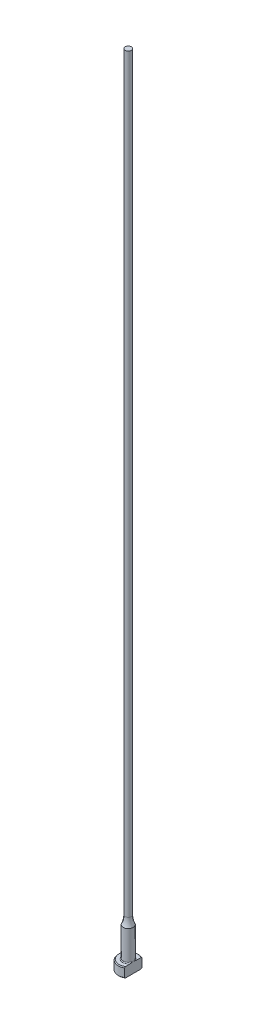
ISO-10303-21;
HEADER;
FILE_DESCRIPTION(('STEP AP214'),'2;1');
FILE_NAME('part.step','',(''),(''),'','','');
FILE_SCHEMA(('AUTOMOTIVE_DESIGN { 1 0 10303 214 1 1 1 1 }'));
ENDSEC;
DATA;
#1=APPLICATION_CONTEXT('core data for automotive mechanical design processes');
#2=APPLICATION_PROTOCOL_DEFINITION('international standard','automotive_design',2000,#1);
#3=PRODUCT_CONTEXT('',#1,'mechanical');
#4=PRODUCT('Part','Part','',(#3));
#5=PRODUCT_RELATED_PRODUCT_CATEGORY('part','',(#4));
#6=PRODUCT_DEFINITION_FORMATION('','',#4);
#7=PRODUCT_DEFINITION_CONTEXT('part definition',#1,'design');
#8=PRODUCT_DEFINITION('design','',#6,#7);
#9=PRODUCT_DEFINITION_SHAPE('','',#8);
#10=(LENGTH_UNIT() NAMED_UNIT(*) SI_UNIT(.MILLI.,.METRE.));
#11=(NAMED_UNIT(*) PLANE_ANGLE_UNIT() SI_UNIT($,.RADIAN.));
#12=(NAMED_UNIT(*) SI_UNIT($,.STERADIAN.) SOLID_ANGLE_UNIT());
#13=UNCERTAINTY_MEASURE_WITH_UNIT(LENGTH_MEASURE(1.E-05),#10,'distance_accuracy_value','');
#14=(GEOMETRIC_REPRESENTATION_CONTEXT(3) GLOBAL_UNCERTAINTY_ASSIGNED_CONTEXT((#13)) GLOBAL_UNIT_ASSIGNED_CONTEXT((#10,
#11,#12)) REPRESENTATION_CONTEXT('',''));
#15=CARTESIAN_POINT('',(0.,0.,0.));
#16=DIRECTION('',(0.,0.,1.));
#17=DIRECTION('',(1.,0.,0.));
#18=AXIS2_PLACEMENT_3D('',#15,#16,#17);
#19=CARTESIAN_POINT('',(-3.17499999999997,3.175,0.));
#20=DIRECTION('',(0.,1.,0.));
#21=DIRECTION('',(0.,0.,1.));
#22=AXIS2_PLACEMENT_3D('',#19,#20,#21);
#23=PLANE('',#22);
#24=CARTESIAN_POINT('',(0.,3.175,0.));
#25=DIRECTION('',(0.,1.,0.));
#26=DIRECTION('',(0.,0.,1.));
#27=AXIS2_PLACEMENT_3D('',#24,#25,#26);
#28=CIRCLE('',#27,2.92099999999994);
#29=CARTESIAN_POINT('',(1.58749999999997,3.175,-2.45195529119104));
#30=VERTEX_POINT('',#29);
#31=CARTESIAN_POINT('',(1.58749999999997,3.175,2.45195529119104));
#32=VERTEX_POINT('',#31);
#33=EDGE_CURVE('E105',#30,#32,#28,.T.);
#34=ORIENTED_EDGE('',*,*,#33,.T.);
#35=DIRECTION('',(0.,0.,1.));
#36=VECTOR('',#35,1.);
#37=CARTESIAN_POINT('',(1.58749999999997,3.17499999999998,2.74963065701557));
#38=LINE('',#37,#36);
#39=CARTESIAN_POINT('',(1.58749999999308,3.175,0.933255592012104));
#40=VERTEX_POINT('',#39);
#41=EDGE_CURVE('E126',#40,#32,#38,.T.);
#42=ORIENTED_EDGE('',*,*,#41,.F.);
#43=CARTESIAN_POINT('',(0.,3.175,0.));
#44=DIRECTION('',(0.,1.,0.));
#45=DIRECTION('',(0.,0.,1.));
#46=AXIS2_PLACEMENT_3D('',#43,#44,#45);
#47=CIRCLE('',#46,1.84149999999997);
#48=CARTESIAN_POINT('',(1.58749999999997,3.17500000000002,-0.933255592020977));
#49=VERTEX_POINT('',#48);
#50=EDGE_CURVE('E11',#40,#49,#47,.F.);
#51=ORIENTED_EDGE('',*,*,#50,.T.);
#52=EDGE_CURVE('E52',#30,#49,#38,.T.);
#53=ORIENTED_EDGE('',*,*,#52,.F.);
#54=EDGE_LOOP('',(#34,#42,#51,#53));
#55=FACE_BOUND('',#54,.T.);
#56=ADVANCED_FACE('F32',(#55),#23,.T.);
#57=CARTESIAN_POINT('',(0.,259.958771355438,0.));
#58=DIRECTION('',(0.,1.,0.));
#59=DIRECTION('',(0.,0.,1.));
#60=AXIS2_PLACEMENT_3D('',#57,#58,#59);
#61=CYLINDRICAL_SURFACE('',#60,3.17499999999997);
#62=CARTESIAN_POINT('',(0.,2.92100000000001,0.));
#63=DIRECTION('',(0.,1.,0.));
#64=DIRECTION('',(0.,0.,1.));
#65=AXIS2_PLACEMENT_3D('',#62,#63,#64);
#66=CIRCLE('',#65,3.17499999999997);
#67=CARTESIAN_POINT('',(1.58749999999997,2.92100000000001,2.74963065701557));
#68=VERTEX_POINT('',#67);
#69=CARTESIAN_POINT('',(1.58749999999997,2.92100000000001,-2.74963065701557));
#70=VERTEX_POINT('',#69);
#71=EDGE_CURVE('E98',#68,#70,#66,.F.);
#72=ORIENTED_EDGE('',*,*,#71,.T.);
#73=DIRECTION('',(0.,-1.,0.));
#74=VECTOR('',#73,1.);
#75=CARTESIAN_POINT('',(1.58749999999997,254.001,-2.74963065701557));
#76=LINE('',#75,#74);
#77=CARTESIAN_POINT('',(1.58749999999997,0.253999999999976,-2.74963065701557));
#78=VERTEX_POINT('',#77);
#79=EDGE_CURVE('E141',#70,#78,#76,.T.);
#80=ORIENTED_EDGE('',*,*,#79,.T.);
#81=CARTESIAN_POINT('',(0.,0.253999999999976,0.));
#82=DIRECTION('',(0.,-1.,0.));
#83=DIRECTION('',(0.,0.,-1.));
#84=AXIS2_PLACEMENT_3D('',#81,#82,#83);
#85=CIRCLE('',#84,3.17499999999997);
#86=CARTESIAN_POINT('',(1.58749999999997,0.253999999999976,2.74963065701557));
#87=VERTEX_POINT('',#86);
#88=EDGE_CURVE('E95',#78,#87,#85,.F.);
#89=ORIENTED_EDGE('',*,*,#88,.T.);
#90=DIRECTION('',(0.,-1.,0.));
#91=VECTOR('',#90,1.);
#92=CARTESIAN_POINT('',(1.58749999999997,254.001,2.74963065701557));
#93=LINE('',#92,#91);
#94=EDGE_CURVE('E88',#68,#87,#93,.T.);
#95=ORIENTED_EDGE('',*,*,#94,.F.);
#96=EDGE_LOOP('',(#72,#80,#89,#95));
#97=FACE_BOUND('',#96,.T.);
#98=ADVANCED_FACE('F191',(#97),#61,.T.);
#99=CARTESIAN_POINT('',(0.,0.,0.));
#100=DIRECTION('',(0.,-1.,0.));
#101=DIRECTION('',(0.,0.,-1.));
#102=AXIS2_PLACEMENT_3D('',#99,#100,#101);
#103=PLANE('',#102);
#104=CARTESIAN_POINT('',(0.,0.,0.));
#105=DIRECTION('',(0.,-1.,0.));
#106=DIRECTION('',(0.,0.,-1.));
#107=AXIS2_PLACEMENT_3D('',#104,#105,#106);
#108=CIRCLE('',#107,2.92100000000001);
#109=CARTESIAN_POINT('',(1.58749999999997,0.,2.45195529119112));
#110=VERTEX_POINT('',#109);
#111=CARTESIAN_POINT('',(1.58749999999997,0.,-2.45195529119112));
#112=VERTEX_POINT('',#111);
#113=EDGE_CURVE('E93',#110,#112,#108,.T.);
#114=ORIENTED_EDGE('',*,*,#113,.T.);
#115=DIRECTION('',(0.,0.,1.));
#116=VECTOR('',#115,1.);
#117=CARTESIAN_POINT('',(1.58749999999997,0.,2.74963065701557));
#118=LINE('',#117,#116);
#119=EDGE_CURVE('E78',#112,#110,#118,.T.);
#120=ORIENTED_EDGE('',*,*,#119,.T.);
#121=EDGE_LOOP('',(#114,#120));
#122=FACE_BOUND('',#121,.T.);
#123=ADVANCED_FACE('F97',(#122),#103,.T.);
#124=CARTESIAN_POINT('',(0.,3.17499999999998,0.));
#125=DIRECTION('',(0.,-1.,0.));
#126=DIRECTION('',(0.,0.,-1.));
#127=AXIS2_PLACEMENT_3D('',#124,#125,#126);
#128=CONICAL_SURFACE('',#127,2.92099999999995,0.785398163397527);
#129=ORIENTED_EDGE('',*,*,#71,.F.);
#130=CARTESIAN_POINT('',(1.58749999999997,-0.16162066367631,-6.0529050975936));
#131=CARTESIAN_POINT('',(1.58749999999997,-0.0288893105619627,-5.91567682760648));
#132=CARTESIAN_POINT('',(1.58749999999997,0.103699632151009,-5.7783103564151));
#133=CARTESIAN_POINT('',(1.58749999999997,0.368508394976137,-5.50321874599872));
#134=CARTESIAN_POINT('',(1.58749999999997,0.500728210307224,-5.36549360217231));
#135=CARTESIAN_POINT('',(1.58749999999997,0.764778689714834,-5.08953516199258));
#136=CARTESIAN_POINT('',(1.58749999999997,0.896609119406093,-4.9513016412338));
#137=CARTESIAN_POINT('',(1.58749999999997,1.15968706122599,-4.67428233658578));
#138=CARTESIAN_POINT('',(1.58749999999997,1.29093457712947,-4.53549655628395));
#139=CARTESIAN_POINT('',(1.58749999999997,1.55007705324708,-4.25997724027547));
#140=CARTESIAN_POINT('',(1.58749999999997,1.67798684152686,-4.12325766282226));
#141=CARTESIAN_POINT('',(1.58749999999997,1.9328486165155,-3.84892898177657));
#142=CARTESIAN_POINT('',(1.58749999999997,2.05980060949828,-3.71131988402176));
#143=CARTESIAN_POINT('',(1.58749999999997,2.31237508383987,-3.43493978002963));
#144=CARTESIAN_POINT('',(1.58749999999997,2.43799784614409,-3.29616903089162));
#145=CARTESIAN_POINT('',(1.58749999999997,2.68741369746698,-3.01699558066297));
#146=CARTESIAN_POINT('',(1.58749999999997,2.81120686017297,-2.8765929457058));
#147=CARTESIAN_POINT('',(1.58749999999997,3.00875865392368,-2.64816703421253));
#148=CARTESIAN_POINT('',(1.58749999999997,3.08336151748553,-2.56087478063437));
#149=CARTESIAN_POINT('',(1.58749999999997,3.2312387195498,-2.38515423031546));
#150=CARTESIAN_POINT('',(1.58749999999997,3.30451292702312,-2.29672582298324));
#151=CARTESIAN_POINT('',(1.58749999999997,3.45004422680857,-2.1174740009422));
#152=CARTESIAN_POINT('',(1.58749999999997,3.5222823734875,-2.02663514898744));
#153=CARTESIAN_POINT('',(1.58749999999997,3.66423097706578,-1.8430252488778));
#154=CARTESIAN_POINT('',(1.58749999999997,3.73394203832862,-1.75025467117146));
#155=CARTESIAN_POINT('',(1.58749999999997,3.87080633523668,-1.5606747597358));
#156=CARTESIAN_POINT('',(1.58749999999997,3.93790459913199,-1.46382547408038));
#157=CARTESIAN_POINT('',(1.58749999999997,4.06669147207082,-1.26632594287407));
#158=CARTESIAN_POINT('',(1.58749999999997,4.1283726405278,-1.16567073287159));
#159=CARTESIAN_POINT('',(1.58749999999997,4.21402252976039,-1.01165766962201));
#160=CARTESIAN_POINT('',(1.58749999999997,4.24127929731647,-0.960142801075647));
#161=CARTESIAN_POINT('',(1.58749999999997,4.2930979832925,-0.855780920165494));
#162=CARTESIAN_POINT('',(1.58749999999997,4.31765941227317,-0.802933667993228));
#163=CARTESIAN_POINT('',(1.58749999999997,4.38614656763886,-0.642461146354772));
#164=CARTESIAN_POINT('',(1.58749999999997,4.42510149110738,-0.532518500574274));
#165=CARTESIAN_POINT('',(1.58749999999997,4.46726244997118,-0.367680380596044));
#166=CARTESIAN_POINT('',(1.58749999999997,4.47844427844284,-0.314802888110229));
#167=CARTESIAN_POINT('',(1.58749999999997,4.49576654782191,-0.208209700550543));
#168=CARTESIAN_POINT('',(1.58749999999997,4.50190743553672,-0.154494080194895));
#169=CARTESIAN_POINT('',(1.58749999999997,4.50871296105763,-0.0468792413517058));
#170=CARTESIAN_POINT('',(1.58749999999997,4.5093945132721,0.00701889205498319));
#171=CARTESIAN_POINT('',(1.58749999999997,4.50527679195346,0.114606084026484));
#172=CARTESIAN_POINT('',(1.58749999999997,4.50047706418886,0.168295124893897));
#173=CARTESIAN_POINT('',(1.58749999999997,4.48579689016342,0.27448544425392));
#174=CARTESIAN_POINT('',(1.58749999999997,4.47596081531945,0.32699298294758));
#175=CARTESIAN_POINT('',(1.58749999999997,4.45181809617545,0.430974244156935));
#176=CARTESIAN_POINT('',(1.58749999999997,4.4375096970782,0.482447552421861));
#177=CARTESIAN_POINT('',(1.58749999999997,4.40502489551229,0.584460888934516));
#178=CARTESIAN_POINT('',(1.58749999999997,4.386827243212,0.634994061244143));
#179=CARTESIAN_POINT('',(1.58749999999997,4.34729308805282,0.734789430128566));
#180=CARTESIAN_POINT('',(1.58749999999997,4.3259572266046,0.784051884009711));
#181=CARTESIAN_POINT('',(1.58749999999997,4.25791922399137,0.930549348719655));
#182=CARTESIAN_POINT('',(1.58749999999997,4.20736047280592,1.0259880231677));
#183=CARTESIAN_POINT('',(1.58749999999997,4.0995545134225,1.21304313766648));
#184=CARTESIAN_POINT('',(1.58749999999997,4.04229912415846,1.30465471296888));
#185=CARTESIAN_POINT('',(1.58749999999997,3.92308746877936,1.48526211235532));
#186=CARTESIAN_POINT('',(1.58749999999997,3.86111349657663,1.57424615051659));
#187=CARTESIAN_POINT('',(1.58749999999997,3.73408621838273,1.74990003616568));
#188=CARTESIAN_POINT('',(1.58749999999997,3.66903444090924,1.83657099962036));
#189=CARTESIAN_POINT('',(1.58749999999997,3.53583371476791,2.00931764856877));
#190=CARTESIAN_POINT('',(1.58749999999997,3.46765527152,2.09537048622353));
#191=CARTESIAN_POINT('',(1.58749999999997,3.32960643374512,2.26611736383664));
#192=CARTESIAN_POINT('',(1.58749999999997,3.25973586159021,2.35081125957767));
#193=CARTESIAN_POINT('',(1.58749999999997,3.04858139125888,2.60290121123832));
#194=CARTESIAN_POINT('',(1.58749999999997,2.90542388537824,2.76872537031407));
#195=CARTESIAN_POINT('',(1.58749999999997,2.64069522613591,3.06970913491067));
#196=CARTESIAN_POINT('',(1.58749999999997,2.51959458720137,3.20528660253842));
#197=CARTESIAN_POINT('',(1.58749999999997,2.27590400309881,3.47510321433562));
#198=CARTESIAN_POINT('',(1.58749999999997,2.15331401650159,3.60934232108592));
#199=CARTESIAN_POINT('',(1.58749999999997,1.90694239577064,3.87695374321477));
#200=CARTESIAN_POINT('',(1.58749999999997,1.78315974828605,4.0103251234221));
#201=CARTESIAN_POINT('',(1.58749999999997,1.53478104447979,4.27630880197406));
#202=CARTESIAN_POINT('',(1.58749999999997,1.41018498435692,4.40892109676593));
#203=CARTESIAN_POINT('',(1.58749999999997,1.0457468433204,4.79499418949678));
#204=CARTESIAN_POINT('',(1.58749999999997,0.80507680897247,5.04767313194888));
#205=CARTESIAN_POINT('',(1.58749999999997,0.443121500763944,5.42550911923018));
#206=CARTESIAN_POINT('',(1.58749999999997,0.322378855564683,5.55118772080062));
#207=CARTESIAN_POINT('',(1.58749999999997,0.0805914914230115,5.80225207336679));
#208=CARTESIAN_POINT('',(1.58749999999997,-0.040453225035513,5.92763782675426));
#209=CARTESIAN_POINT('',(1.58749999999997,-0.161620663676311,6.0529050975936));
#210=B_SPLINE_CURVE_WITH_KNOTS('',3,(#130,#131,#132,#133,#134,#135,#136,#137,#138,#139,#140,
#141,#142,#143,#144,#145,#146,#147,#148,#149,#150,#151,#152,#153,#154,#155,#156,#157,#158,#159,
#160,#161,#162,#163,#164,#165,#166,#167,#168,#169,#170,#171,#172,#173,#174,#175,#176,#177,#178,
#179,#180,#181,#182,#183,#184,#185,#186,#187,#188,#189,#190,#191,#192,#193,#194,#195,#196,#197,
#198,#199,#200,#201,#202,#203,#204,#205,#206,#207,#208,#209),.UNSPECIFIED.,.F.,.F.,(4,2,2,2,2,2,
2,2,2,2,2,2,2,2,2,2,2,2,2,2,2,2,2,2,2,2,2,2,2,2,2,2,2,2,2,2,2,2,2,4),(0.,0.572750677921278,
1.14550874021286,1.71856057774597,2.29160869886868,2.85328006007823,3.4149477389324,
3.97649423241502,4.53801804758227,4.88249307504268,5.22700189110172,5.5751532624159,
5.92322081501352,6.27657800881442,6.63041319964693,6.80518126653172,6.9799810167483,
7.3282426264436,7.49018491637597,7.65211285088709,7.81353889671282,7.97497832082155,
8.13501929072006,8.29512313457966,8.45612518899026,8.61709438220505,8.94062993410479,
9.2645649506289,9.58978187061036,9.91483894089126,10.2441741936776,10.5735441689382,
11.2306812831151,11.7760337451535,12.3214014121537,12.8672825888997,13.4131663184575,
14.4600164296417,14.9828595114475,15.5056983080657),.UNSPECIFIED.);
#211=EDGE_CURVE('E118',#32,#68,#210,.T.);
#212=ORIENTED_EDGE('',*,*,#211,.F.);
#213=ORIENTED_EDGE('',*,*,#33,.F.);
#214=EDGE_CURVE('E117',#70,#30,#210,.T.);
#215=ORIENTED_EDGE('',*,*,#214,.F.);
#216=EDGE_LOOP('',(#129,#212,#213,#215));
#217=FACE_BOUND('',#216,.T.);
#218=ADVANCED_FACE('F162',(#217),#128,.T.);
#219=CARTESIAN_POINT('',(0.,0.253999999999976,0.));
#220=DIRECTION('',(0.,1.,0.));
#221=DIRECTION('',(0.,0.,1.));
#222=AXIS2_PLACEMENT_3D('',#219,#220,#221);
#223=CONICAL_SURFACE('',#222,3.17499999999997,0.785398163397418);
#224=ORIENTED_EDGE('',*,*,#88,.F.);
#225=CARTESIAN_POINT('',(1.58749999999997,3.33662066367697,6.0529050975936));
#226=CARTESIAN_POINT('',(1.58749999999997,3.20388931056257,5.91567682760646));
#227=CARTESIAN_POINT('',(1.58749999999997,3.07130036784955,5.77831035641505));
#228=CARTESIAN_POINT('',(1.58749999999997,2.80649160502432,5.50321874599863));
#229=CARTESIAN_POINT('',(1.58749999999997,2.67427178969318,5.3654936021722));
#230=CARTESIAN_POINT('',(1.58749999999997,2.41022131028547,5.08953516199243));
#231=CARTESIAN_POINT('',(1.58749999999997,2.27839088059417,4.95130164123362));
#232=CARTESIAN_POINT('',(1.58749999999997,2.01531293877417,4.67428233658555));
#233=CARTESIAN_POINT('',(1.58749999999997,1.88406542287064,4.5354965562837));
#234=CARTESIAN_POINT('',(1.58749999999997,1.62492294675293,4.25997724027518));
#235=CARTESIAN_POINT('',(1.58749999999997,1.49701315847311,4.12325766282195));
#236=CARTESIAN_POINT('',(1.58749999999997,1.24215138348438,3.84892898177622));
#237=CARTESIAN_POINT('',(1.58749999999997,1.11519939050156,3.71131988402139));
#238=CARTESIAN_POINT('',(1.58749999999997,0.862624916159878,3.43493978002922));
#239=CARTESIAN_POINT('',(1.58749999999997,0.737002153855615,3.29616903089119));
#240=CARTESIAN_POINT('',(1.58749999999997,0.487586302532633,3.01699558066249));
#241=CARTESIAN_POINT('',(1.58749999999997,0.363793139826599,2.8765929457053));
#242=CARTESIAN_POINT('',(1.58749999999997,0.166241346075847,2.64816703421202));
#243=CARTESIAN_POINT('',(1.58749999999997,0.0916384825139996,2.56087478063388));
#244=CARTESIAN_POINT('',(1.58749999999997,-0.0562387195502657,2.385154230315));
#245=CARTESIAN_POINT('',(1.58749999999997,-0.129512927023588,2.29672582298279));
#246=CARTESIAN_POINT('',(1.58749999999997,-0.27504422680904,2.11747400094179));
#247=CARTESIAN_POINT('',(1.58749999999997,-0.347282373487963,2.02663514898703));
#248=CARTESIAN_POINT('',(1.58749999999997,-0.489230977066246,1.84302524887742));
#249=CARTESIAN_POINT('',(1.58749999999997,-0.558942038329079,1.7502546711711));
#250=CARTESIAN_POINT('',(1.58749999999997,-0.695806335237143,1.56067475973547));
#251=CARTESIAN_POINT('',(1.58749999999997,-0.762904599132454,1.46382547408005));
#252=CARTESIAN_POINT('',(1.58749999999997,-0.891691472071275,1.26632594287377));
#253=CARTESIAN_POINT('',(1.58749999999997,-0.953372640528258,1.16567073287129));
#254=CARTESIAN_POINT('',(1.58749999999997,-1.03902252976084,1.01165766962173));
#255=CARTESIAN_POINT('',(1.58749999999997,-1.06627929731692,0.960142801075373));
#256=CARTESIAN_POINT('',(1.58749999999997,-1.11809798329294,0.85578092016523));
#257=CARTESIAN_POINT('',(1.58749999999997,-1.14265941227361,0.802933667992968));
#258=CARTESIAN_POINT('',(1.58749999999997,-1.21114656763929,0.642461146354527));
#259=CARTESIAN_POINT('',(1.58749999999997,-1.2501014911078,0.532518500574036));
#260=CARTESIAN_POINT('',(1.58749999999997,-1.29226244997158,0.367680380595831));
#261=CARTESIAN_POINT('',(1.58749999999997,-1.30344427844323,0.314802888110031));
#262=CARTESIAN_POINT('',(1.58749999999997,-1.32076654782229,0.208209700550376));
#263=CARTESIAN_POINT('',(1.58749999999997,-1.3269074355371,0.154494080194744));
#264=CARTESIAN_POINT('',(1.58749999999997,-1.333712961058,0.0468792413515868));
#265=CARTESIAN_POINT('',(1.58749999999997,-1.33439451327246,-0.00701889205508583));
#266=CARTESIAN_POINT('',(1.58749999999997,-1.33027679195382,-0.114606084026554));
#267=CARTESIAN_POINT('',(1.58749999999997,-1.32547706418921,-0.168295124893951));
#268=CARTESIAN_POINT('',(1.58749999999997,-1.31079689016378,-0.274485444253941));
#269=CARTESIAN_POINT('',(1.58749999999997,-1.3009608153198,-0.326992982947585));
#270=CARTESIAN_POINT('',(1.58749999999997,-1.27681809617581,-0.430974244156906));
#271=CARTESIAN_POINT('',(1.58749999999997,-1.26250969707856,-0.482447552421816));
#272=CARTESIAN_POINT('',(1.58749999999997,-1.23002489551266,-0.584460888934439));
#273=CARTESIAN_POINT('',(1.58749999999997,-1.21182724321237,-0.634994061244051));
#274=CARTESIAN_POINT('',(1.58749999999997,-1.1722930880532,-0.734789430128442));
#275=CARTESIAN_POINT('',(1.58749999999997,-1.15095722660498,-0.784051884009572));
#276=CARTESIAN_POINT('',(1.58749999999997,-1.08291922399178,-0.93054934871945));
#277=CARTESIAN_POINT('',(1.58749999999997,-1.03236047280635,-1.02598802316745));
#278=CARTESIAN_POINT('',(1.58749999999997,-0.924554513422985,-1.21304313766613));
#279=CARTESIAN_POINT('',(1.58749999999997,-0.86729912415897,-1.30465471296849));
#280=CARTESIAN_POINT('',(1.58749999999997,-0.748087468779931,-1.48526211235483));
#281=CARTESIAN_POINT('',(1.58749999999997,-0.686113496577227,-1.57424615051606));
#282=CARTESIAN_POINT('',(1.58749999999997,-0.55908621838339,-1.74990003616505));
#283=CARTESIAN_POINT('',(1.58749999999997,-0.494034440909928,-1.83657099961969));
#284=CARTESIAN_POINT('',(1.58749999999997,-0.360833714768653,-2.00931764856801));
#285=CARTESIAN_POINT('',(1.58749999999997,-0.292655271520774,-2.09537048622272));
#286=CARTESIAN_POINT('',(1.58749999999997,-0.154606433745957,-2.26611736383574));
#287=CARTESIAN_POINT('',(1.58749999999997,-0.0847358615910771,-2.35081125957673));
#288=CARTESIAN_POINT('',(1.58749999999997,0.126418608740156,-2.60290121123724));
#289=CARTESIAN_POINT('',(1.58749999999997,0.269576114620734,-2.76872537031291));
#290=CARTESIAN_POINT('',(1.58749999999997,0.534304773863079,-3.06970913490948));
#291=CARTESIAN_POINT('',(1.58749999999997,0.655405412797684,-3.20528660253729));
#292=CARTESIAN_POINT('',(1.58749999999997,0.899095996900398,-3.47510321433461));
#293=CARTESIAN_POINT('',(1.58749999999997,1.02168598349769,-3.60934232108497));
#294=CARTESIAN_POINT('',(1.58749999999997,1.26805760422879,-3.87695374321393));
#295=CARTESIAN_POINT('',(1.58749999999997,1.39184025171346,-4.01032512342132));
#296=CARTESIAN_POINT('',(1.58749999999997,1.64021895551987,-4.2763088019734));
#297=CARTESIAN_POINT('',(1.58749999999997,1.76481501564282,-4.40892109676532));
#298=CARTESIAN_POINT('',(1.58749999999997,2.12925315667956,-4.79499418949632));
#299=CARTESIAN_POINT('',(1.58749999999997,2.36992319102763,-5.04767313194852));
#300=CARTESIAN_POINT('',(1.58749999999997,2.73187849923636,-5.42550911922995));
#301=CARTESIAN_POINT('',(1.58749999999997,2.85262114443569,-5.55118772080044));
#302=CARTESIAN_POINT('',(1.58749999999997,3.09440850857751,-5.8022520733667));
#303=CARTESIAN_POINT('',(1.58749999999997,3.2154532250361,-5.92763782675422));
#304=CARTESIAN_POINT('',(1.58749999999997,3.33662066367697,-6.0529050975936));
#305=B_SPLINE_CURVE_WITH_KNOTS('',3,(#225,#226,#227,#228,#229,#230,#231,#232,#233,#234,#235,
#236,#237,#238,#239,#240,#241,#242,#243,#244,#245,#246,#247,#248,#249,#250,#251,#252,#253,#254,
#255,#256,#257,#258,#259,#260,#261,#262,#263,#264,#265,#266,#267,#268,#269,#270,#271,#272,#273,
#274,#275,#276,#277,#278,#279,#280,#281,#282,#283,#284,#285,#286,#287,#288,#289,#290,#291,#292,
#293,#294,#295,#296,#297,#298,#299,#300,#301,#302,#303,#304),.UNSPECIFIED.,.F.,.F.,(4,2,2,2,2,2,
2,2,2,2,2,2,2,2,2,2,2,2,2,2,2,2,2,2,2,2,2,2,2,2,2,2,2,2,2,2,2,2,2,4),(0.,0.57275067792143,
1.14550874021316,1.71856057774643,2.29160869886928,2.85328006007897,3.41494773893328,
3.97649423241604,4.53801804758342,4.88249307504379,5.2270018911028,5.57515326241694,
5.92322081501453,6.27657800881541,6.63041319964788,6.80518126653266,6.97998101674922,
7.32824262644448,7.49018491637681,7.65211285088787,7.81353889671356,7.97497832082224,
8.1350192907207,8.29512313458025,8.45612518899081,8.61709438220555,8.94062993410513,
9.26456495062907,9.58978187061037,9.91483894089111,10.2441741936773,10.5735441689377,
11.2306812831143,11.776033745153,12.3214014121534,12.8672825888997,13.4131663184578,
14.4600164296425,14.9828595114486,15.505698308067),.UNSPECIFIED.);
#306=EDGE_CURVE('E81',#112,#78,#305,.T.);
#307=ORIENTED_EDGE('',*,*,#306,.F.);
#308=ORIENTED_EDGE('',*,*,#113,.F.);
#309=EDGE_CURVE('E84',#87,#110,#305,.T.);
#310=ORIENTED_EDGE('',*,*,#309,.F.);
#311=EDGE_LOOP('',(#224,#307,#308,#310));
#312=FACE_BOUND('',#311,.T.);
#313=ADVANCED_FACE('F92',(#312),#223,.T.);
#314=CARTESIAN_POINT('',(0.,3.42900000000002,0.));
#315=DIRECTION('',(0.,1.,0.));
#316=DIRECTION('',(0.,0.,1.));
#317=AXIS2_PLACEMENT_3D('',#314,#315,#316);
#318=TOROIDAL_SURFACE('',#317,1.84149999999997,0.254);
#319=CARTESIAN_POINT('',(1.58749999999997,3.42900000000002,0.));
#320=CARTESIAN_POINT('',(1.58749999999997,3.42899942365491,-1.9220514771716E-10));
#321=CARTESIAN_POINT('',(1.58749999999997,3.42899884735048,-1.2261161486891E-07));
#322=CARTESIAN_POINT('',(1.58749999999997,3.42899773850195,-5.09676365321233E-07));
#323=CARTESIAN_POINT('',(1.58749999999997,3.42899720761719,-7.78176328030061E-07));
#324=CARTESIAN_POINT('',(1.58749999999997,3.42899614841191,-1.42307272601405E-06));
#325=CARTESIAN_POINT('',(1.58749999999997,3.42899562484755,-1.80713867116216E-06));
#326=CARTESIAN_POINT('',(1.58749999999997,3.42899463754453,-2.63494846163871E-06));
#327=CARTESIAN_POINT('',(1.58749999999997,3.42899417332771,-3.07814756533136E-06));
#328=CARTESIAN_POINT('',(1.58749999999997,3.42899261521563,-4.66897357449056E-06));
#329=CARTESIAN_POINT('',(1.58749999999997,3.42899159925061,-5.89404908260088E-06));
#330=CARTESIAN_POINT('',(1.58749999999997,3.42898979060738,-8.42427511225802E-06));
#331=CARTESIAN_POINT('',(1.58749999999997,3.42898899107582,-9.7248057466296E-06));
#332=CARTESIAN_POINT('',(1.58749999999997,3.42898598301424,-1.48060601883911E-05));
#333=CARTESIAN_POINT('',(1.58749999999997,3.42898393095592,-1.86838281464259E-05));
#334=CARTESIAN_POINT('',(1.58749999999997,3.42898057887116,-2.63261117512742E-05));
#335=CARTESIAN_POINT('',(1.58749999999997,3.42897922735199,-3.00687417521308E-05));
#336=CARTESIAN_POINT('',(1.58749999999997,3.42897347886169,-4.60276298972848E-05));
#337=CARTESIAN_POINT('',(1.58749999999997,3.42896911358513,-5.8247019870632E-05));
#338=CARTESIAN_POINT('',(1.58749999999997,3.42896211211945,-8.11070097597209E-05));
#339=CARTESIAN_POINT('',(1.58749999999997,3.42895931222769,-9.16953114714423E-05));
#340=CARTESIAN_POINT('',(1.58749999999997,3.42893712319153,-0.000168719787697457));
#341=CARTESIAN_POINT('',(1.58749999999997,3.42890881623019,-0.000232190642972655));
#342=CARTESIAN_POINT('',(1.58749999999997,3.42880276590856,-0.000479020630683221));
#343=CARTESIAN_POINT('',(1.58749999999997,3.42873165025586,-0.00066443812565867));
#344=CARTESIAN_POINT('',(1.58749999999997,3.42845137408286,-0.0013844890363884));
#345=CARTESIAN_POINT('',(1.58749999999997,3.42823526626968,-0.00191701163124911));
#346=CARTESIAN_POINT('',(1.58749999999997,3.42735449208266,-0.00409774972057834));
#347=CARTESIAN_POINT('',(1.58749999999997,3.42669768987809,-0.00574830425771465));
#348=CARTESIAN_POINT('',(1.58749999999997,3.4174405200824,-0.0289985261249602));
#349=CARTESIAN_POINT('',(1.58749999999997,3.40878325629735,-0.0505816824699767));
#350=CARTESIAN_POINT('',(1.58749999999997,3.39189297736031,-0.0929947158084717));
#351=CARTESIAN_POINT('',(1.58749999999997,3.38365605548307,-0.11382315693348));
#352=CARTESIAN_POINT('',(1.58749999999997,3.36635393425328,-0.157956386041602));
#353=CARTESIAN_POINT('',(1.58749999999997,3.35730391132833,-0.181267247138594));
#354=CARTESIAN_POINT('',(1.58749999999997,3.33936775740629,-0.228222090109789));
#355=CARTESIAN_POINT('',(1.58749999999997,3.33048420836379,-0.25186705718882));
#356=CARTESIAN_POINT('',(1.58749999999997,3.30894496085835,-0.310512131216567));
#357=CARTESIAN_POINT('',(1.58749999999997,3.29649449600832,-0.345588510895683));
#358=CARTESIAN_POINT('',(1.58749999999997,3.27296975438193,-0.415278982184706));
#359=CARTESIAN_POINT('',(1.58749999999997,3.26186987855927,-0.449884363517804));
#360=CARTESIAN_POINT('',(1.58749999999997,3.2395832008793,-0.524471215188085));
#361=CARTESIAN_POINT('',(1.58749999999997,3.22860862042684,-0.564517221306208));
#362=CARTESIAN_POINT('',(1.58749999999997,3.20902534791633,-0.645529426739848));
#363=CARTESIAN_POINT('',(1.58749999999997,3.20043582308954,-0.686500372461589));
#364=CARTESIAN_POINT('',(1.58749999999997,3.18611712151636,-0.771546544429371));
#365=CARTESIAN_POINT('',(1.58749999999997,3.18059550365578,-0.815658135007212));
#366=CARTESIAN_POINT('',(1.58749999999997,3.17455396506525,-0.904117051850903));
#367=CARTESIAN_POINT('',(1.58749999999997,3.17401361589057,-0.948462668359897));
#368=CARTESIAN_POINT('',(1.58749999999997,3.17898948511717,-1.02531896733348));
#369=CARTESIAN_POINT('',(1.58749999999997,3.1829739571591,-1.05792141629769));
#370=CARTESIAN_POINT('',(1.58749999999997,3.19569167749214,-1.12184393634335));
#371=CARTESIAN_POINT('',(1.58749999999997,3.20436049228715,-1.1531753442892));
#372=CARTESIAN_POINT('',(1.58749999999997,3.22236152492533,-1.19946468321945));
#373=CARTESIAN_POINT('',(1.58749999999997,3.2295150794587,-1.21526783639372));
#374=CARTESIAN_POINT('',(1.58749999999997,3.24587062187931,-1.24583726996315));
#375=CARTESIAN_POINT('',(1.58749999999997,3.25507530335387,-1.26060215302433));
#376=CARTESIAN_POINT('',(1.58749999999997,3.27378481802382,-1.28575815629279));
#377=CARTESIAN_POINT('',(1.58749999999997,3.28289001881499,-1.29644383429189));
#378=CARTESIAN_POINT('',(1.58749999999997,3.30268460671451,-1.31623154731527));
#379=CARTESIAN_POINT('',(1.58749999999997,3.31337067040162,-1.32533681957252));
#380=CARTESIAN_POINT('',(1.58749999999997,3.33349977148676,-1.33941140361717));
#381=CARTESIAN_POINT('',(1.58749999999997,3.34261446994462,-1.34484814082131));
#382=CARTESIAN_POINT('',(1.58749999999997,3.36161455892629,-1.35416329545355));
#383=CARTESIAN_POINT('',(1.58749999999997,3.37149946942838,-1.35804267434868));
#384=CARTESIAN_POINT('',(1.58749999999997,3.39188678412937,-1.36398436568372));
#385=CARTESIAN_POINT('',(1.58749999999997,3.40239309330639,-1.36603350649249));
#386=CARTESIAN_POINT('',(1.58749999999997,3.42360372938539,-1.3680840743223));
#387=CARTESIAN_POINT('',(1.58749999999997,3.43430795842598,-1.36808648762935));
#388=CARTESIAN_POINT('',(1.58749999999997,3.45433283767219,-1.36616208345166));
#389=CARTESIAN_POINT('',(1.58749999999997,3.46367506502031,-1.36444960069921));
#390=CARTESIAN_POINT('',(1.58749999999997,3.48195519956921,-1.35953338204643));
#391=CARTESIAN_POINT('',(1.58749999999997,3.49089304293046,-1.3563294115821));
#392=CARTESIAN_POINT('',(1.58749999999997,3.50850302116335,-1.34848006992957));
#393=CARTESIAN_POINT('',(1.58749999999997,3.5171531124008,-1.34378578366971));
#394=CARTESIAN_POINT('',(1.58749999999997,3.53371257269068,-1.33324445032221));
#395=CARTESIAN_POINT('',(1.58749999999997,3.54162163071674,-1.32739692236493));
#396=CARTESIAN_POINT('',(1.58749999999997,3.56107121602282,-1.31107304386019));
#397=CARTESIAN_POINT('',(1.58749999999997,3.57202221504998,-1.29989286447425));
#398=CARTESIAN_POINT('',(1.58749999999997,3.59202509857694,-1.27593566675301));
#399=CARTESIAN_POINT('',(1.58749999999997,3.60107086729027,-1.26315370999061));
#400=CARTESIAN_POINT('',(1.58749999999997,3.62186023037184,-1.22930733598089));
#401=CARTESIAN_POINT('',(1.58749999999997,3.63240584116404,-1.20751096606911));
#402=CARTESIAN_POINT('',(1.58749999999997,3.65004643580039,-1.16266144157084));
#403=CARTESIAN_POINT('',(1.58749999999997,3.65714435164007,-1.13960937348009));
#404=CARTESIAN_POINT('',(1.58749999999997,3.67265428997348,-1.07603916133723));
#405=CARTESIAN_POINT('',(1.58749999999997,3.67834921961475,-1.03486686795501));
#406=CARTESIAN_POINT('',(1.58749999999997,3.68382880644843,-0.951558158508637));
#407=CARTESIAN_POINT('',(1.58749999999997,3.68350976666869,-0.909417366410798));
#408=CARTESIAN_POINT('',(1.58749999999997,3.67745397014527,-0.811383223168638));
#409=CARTESIAN_POINT('',(1.58749999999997,3.66993873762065,-0.755610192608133));
#410=CARTESIAN_POINT('',(1.58749999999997,3.64933373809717,-0.644937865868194));
#411=CARTESIAN_POINT('',(1.58749999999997,3.63621897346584,-0.59004364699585));
#412=CARTESIAN_POINT('',(1.58749999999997,3.60740922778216,-0.485757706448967));
#413=CARTESIAN_POINT('',(1.58749999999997,3.59201096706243,-0.436281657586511));
#414=CARTESIAN_POINT('',(1.58749999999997,3.55922497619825,-0.338551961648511));
#415=CARTESIAN_POINT('',(1.58749999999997,3.5418584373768,-0.290291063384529));
#416=CARTESIAN_POINT('',(1.58749999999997,3.51760237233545,-0.225557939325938));
#417=CARTESIAN_POINT('',(1.58749999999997,3.51126413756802,-0.208874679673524));
#418=CARTESIAN_POINT('',(1.58749999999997,3.49830042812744,-0.17512392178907));
#419=CARTESIAN_POINT('',(1.58749999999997,3.49167176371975,-0.158057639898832));
#420=CARTESIAN_POINT('',(1.58749999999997,3.47585523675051,-0.117638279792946));
#421=CARTESIAN_POINT('',(1.58749999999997,3.46662970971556,-0.0943002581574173));
#422=CARTESIAN_POINT('',(1.58749999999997,3.44889695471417,-0.0497824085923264));
#423=CARTESIAN_POINT('',(1.58749999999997,3.44040039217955,-0.028598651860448));
#424=CARTESIAN_POINT('',(1.58749999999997,3.43130364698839,-0.00575168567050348));
#425=CARTESIAN_POINT('',(1.58749999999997,3.43064818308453,-0.00410451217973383));
#426=CARTESIAN_POINT('',(1.58749999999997,3.42976776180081,-0.00192459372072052));
#427=CARTESIAN_POINT('',(1.58749999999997,3.42955062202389,-0.00138952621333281));
#428=CARTESIAN_POINT('',(1.58749999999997,3.42926908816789,-0.000666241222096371));
#429=CARTESIAN_POINT('',(1.58749999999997,3.42919771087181,-0.000480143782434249));
#430=CARTESIAN_POINT('',(1.58749999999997,3.42909131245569,-0.000232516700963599));
#431=CARTESIAN_POINT('',(1.58749999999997,3.42906294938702,-0.000168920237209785));
#432=CARTESIAN_POINT('',(1.58749999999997,3.42904072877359,-9.17527162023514E-05));
#433=CARTESIAN_POINT('',(1.58749999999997,3.42903792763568,-8.11550293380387E-05));
#434=CARTESIAN_POINT('',(1.58749999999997,3.42903091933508,-5.82743948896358E-05));
#435=CARTESIAN_POINT('',(1.58749999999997,3.42902654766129,-4.60440001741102E-05));
#436=CARTESIAN_POINT('',(1.58749999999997,3.42902079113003,-3.00727682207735E-05));
#437=CARTESIAN_POINT('',(1.58749999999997,3.42901943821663,-2.63286807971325E-05));
#438=CARTESIAN_POINT('',(1.58749999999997,3.42901608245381,-1.86836529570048E-05));
#439=CARTESIAN_POINT('',(1.58749999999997,3.4290140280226,-1.48046517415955E-05));
#440=CARTESIAN_POINT('',(1.58749999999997,3.42901101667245,-9.72223943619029E-06));
#441=CARTESIAN_POINT('',(1.58749999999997,3.42901021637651,-8.42159649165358E-06));
#442=CARTESIAN_POINT('',(1.58749999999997,3.42900840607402,-5.89129729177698E-06));
#443=CARTESIAN_POINT('',(1.58749999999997,3.42900738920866,-4.66626867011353E-06));
#444=CARTESIAN_POINT('',(1.58749999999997,3.42900582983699,-3.07568803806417E-06));
#445=CARTESIAN_POINT('',(1.58749999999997,3.42900536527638,-2.63259565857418E-06));
#446=CARTESIAN_POINT('',(1.58749999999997,3.4290043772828,-1.80506085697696E-06));
#447=CARTESIAN_POINT('',(1.58749999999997,3.42900385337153,-1.42116387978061E-06));
#448=CARTESIAN_POINT('',(1.58749999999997,3.42900279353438,-7.76675643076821E-07));
#449=CARTESIAN_POINT('',(1.58749999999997,3.42900226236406,-5.08406487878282E-07));
#450=CARTESIAN_POINT('',(1.58749999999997,3.42900115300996,-1.21901887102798E-07));
#451=CARTESIAN_POINT('',(1.58749999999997,3.42900057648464,1.92251677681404E-10));
#452=CARTESIAN_POINT('',(1.58749999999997,3.42900000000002,0.));
#453=B_SPLINE_CURVE_WITH_KNOTS('',3,(#319,#320,#321,#322,#323,#324,#325,#326,#327,#328,#329,
#330,#331,#332,#333,#334,#335,#336,#337,#338,#339,#340,#341,#342,#343,#344,#345,#346,#347,#348,
#349,#350,#351,#352,#353,#354,#355,#356,#357,#358,#359,#360,#361,#362,#363,#364,#365,#366,#367,
#368,#369,#370,#371,#372,#373,#374,#375,#376,#377,#378,#379,#380,#381,#382,#383,#384,#385,#386,
#387,#388,#389,#390,#391,#392,#393,#394,#395,#396,#397,#398,#399,#400,#401,#402,#403,#404,#405,
#406,#407,#408,#409,#410,#411,#412,#413,#414,#415,#416,#417,#418,#419,#420,#421,#422,#423,#424,
#425,#426,#427,#428,#429,#430,#431,#432,#433,#434,#435,#436,#437,#438,#439,#440,#441,#442,#443,
#444,#445,#446,#447,#448,#449,#450,#451,#452),.UNSPECIFIED.,.T.,.F.,(4,2,2,2,2,2,2,2,2,2,2,2,2,
2,2,2,2,2,2,2,2,2,2,2,2,2,2,2,2,2,2,2,2,2,2,2,2,2,2,2,2,2,2,2,2,2,2,2,2,2,2,2,2,2,2,2,2,2,2,2,2,
2,2,2,2,2,4),(0.,1.72815458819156E-06,3.50429255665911E-06,5.44431004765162E-06,
7.3675525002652E-06,1.2119089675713E-05,1.66953775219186E-05,2.98160400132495E-05,
4.17409564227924E-05,8.0660475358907E-05,0.000113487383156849,0.000321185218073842,
0.000917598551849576,0.00264089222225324,0.00797105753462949,0.0777276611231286,
0.144923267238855,0.219939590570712,0.295714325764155,0.407362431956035,0.516367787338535,
0.640878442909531,0.766362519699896,0.899536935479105,1.03216495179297,1.13045740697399,
1.22743103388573,1.27935899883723,1.33135556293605,1.37333248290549,1.41522237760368,
1.44693946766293,1.47863694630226,1.51056074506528,1.54246916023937,1.57083210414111,
1.59919951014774,1.62861579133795,1.65804436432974,1.70472658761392,1.75155645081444,
1.82378709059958,1.89595619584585,2.01995471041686,2.1460932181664,2.31447224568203,
2.48361094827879,2.6389891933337,2.79283011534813,2.84637031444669,2.9012946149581,
2.97658236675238,3.04504771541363,3.05036697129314,3.05209849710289,3.05269709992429,
3.05290520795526,3.05293806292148,3.05297701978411,3.05298895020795,3.05300207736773,
3.05300665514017,3.0530114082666,3.05301333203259,3.05301527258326,3.05301704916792,
3.05301877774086),.UNSPECIFIED.);
#454=CARTESIAN_POINT('',(1.58749999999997,3.42900000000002,0.));
#455=VERTEX_POINT('',#454);
#456=EDGE_CURVE('E47',#455,#49,#453,.T.);
#457=ORIENTED_EDGE('',*,*,#456,.T.);
#458=ORIENTED_EDGE('',*,*,#50,.F.);
#459=CARTESIAN_POINT('',(1.58749999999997,3.42900000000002,0.));
#460=CARTESIAN_POINT('',(1.58749999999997,3.42900057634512,1.9220512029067E-10));
#461=CARTESIAN_POINT('',(1.58749999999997,3.42900115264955,1.22611614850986E-07));
#462=CARTESIAN_POINT('',(1.58749999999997,3.42900226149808,5.09676365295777E-07));
#463=CARTESIAN_POINT('',(1.58749999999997,3.42900279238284,7.78176328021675E-07));
#464=CARTESIAN_POINT('',(1.58749999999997,3.42900385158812,1.42307272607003E-06));
#465=CARTESIAN_POINT('',(1.58749999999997,3.42900437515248,1.80713867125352E-06));
#466=CARTESIAN_POINT('',(1.58749999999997,3.4290053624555,2.63494846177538E-06));
#467=CARTESIAN_POINT('',(1.58749999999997,3.42900582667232,3.0781475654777E-06));
#468=CARTESIAN_POINT('',(1.58749999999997,3.4290073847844,4.66897357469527E-06));
#469=CARTESIAN_POINT('',(1.58749999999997,3.42900840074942,5.89404908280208E-06));
#470=CARTESIAN_POINT('',(1.58749999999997,3.42901020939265,8.42427511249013E-06));
#471=CARTESIAN_POINT('',(1.58749999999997,3.42901100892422,9.72480574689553E-06));
#472=CARTESIAN_POINT('',(1.58749999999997,3.42901401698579,1.48060601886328E-05));
#473=CARTESIAN_POINT('',(1.58749999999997,3.42901606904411,1.86838281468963E-05));
#474=CARTESIAN_POINT('',(1.58749999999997,3.42901942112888,2.63261117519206E-05));
#475=CARTESIAN_POINT('',(1.58749999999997,3.42902077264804,3.00687417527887E-05));
#476=CARTESIAN_POINT('',(1.58749999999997,3.42902652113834,4.60276298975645E-05));
#477=CARTESIAN_POINT('',(1.58749999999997,3.4290308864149,5.82470198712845E-05));
#478=CARTESIAN_POINT('',(1.58749999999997,3.42903788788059,8.11070097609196E-05));
#479=CARTESIAN_POINT('',(1.58749999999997,3.42904068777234,9.16953114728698E-05));
#480=CARTESIAN_POINT('',(1.58749999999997,3.4290628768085,0.000168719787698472));
#481=CARTESIAN_POINT('',(1.58749999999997,3.42909118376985,0.000232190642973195));
#482=CARTESIAN_POINT('',(1.58749999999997,3.42919723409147,0.000479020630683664));
#483=CARTESIAN_POINT('',(1.58749999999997,3.42926834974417,0.000664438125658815));
#484=CARTESIAN_POINT('',(1.58749999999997,3.42954862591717,0.00138448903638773));
#485=CARTESIAN_POINT('',(1.58749999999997,3.42976473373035,0.00191701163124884));
#486=CARTESIAN_POINT('',(1.58749999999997,3.43064550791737,0.00409774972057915));
#487=CARTESIAN_POINT('',(1.58749999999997,3.43130231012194,0.00574830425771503));
#488=CARTESIAN_POINT('',(1.58749999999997,3.44055947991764,0.0289985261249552));
#489=CARTESIAN_POINT('',(1.58749999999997,3.44921674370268,0.0505816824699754));
#490=CARTESIAN_POINT('',(1.58749999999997,3.46610702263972,0.0929947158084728));
#491=CARTESIAN_POINT('',(1.58749999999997,3.47434394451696,0.11382315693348));
#492=CARTESIAN_POINT('',(1.58749999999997,3.49164606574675,0.157956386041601));
#493=CARTESIAN_POINT('',(1.58749999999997,3.5006960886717,0.181267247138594));
#494=CARTESIAN_POINT('',(1.58749999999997,3.51863224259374,0.228222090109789));
#495=CARTESIAN_POINT('',(1.58749999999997,3.52751579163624,0.25186705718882));
#496=CARTESIAN_POINT('',(1.58749999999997,3.54905503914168,0.310512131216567));
#497=CARTESIAN_POINT('',(1.58749999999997,3.56150550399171,0.345588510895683));
#498=CARTESIAN_POINT('',(1.58749999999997,3.5850302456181,0.415278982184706));
#499=CARTESIAN_POINT('',(1.58749999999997,3.59613012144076,0.449884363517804));
#500=CARTESIAN_POINT('',(1.58749999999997,3.61841679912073,0.524471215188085));
#501=CARTESIAN_POINT('',(1.58749999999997,3.62939137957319,0.564517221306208));
#502=CARTESIAN_POINT('',(1.58749999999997,3.6489746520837,0.645529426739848));
#503=CARTESIAN_POINT('',(1.58749999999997,3.65756417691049,0.686500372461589));
#504=CARTESIAN_POINT('',(1.58749999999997,3.67188287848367,0.771546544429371));
#505=CARTESIAN_POINT('',(1.58749999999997,3.67740449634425,0.815658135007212));
#506=CARTESIAN_POINT('',(1.58749999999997,3.68344603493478,0.904117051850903));
#507=CARTESIAN_POINT('',(1.58749999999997,3.68398638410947,0.948462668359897));
#508=CARTESIAN_POINT('',(1.58749999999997,3.67901051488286,1.02531896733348));
#509=CARTESIAN_POINT('',(1.58749999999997,3.67502604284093,1.05792141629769));
#510=CARTESIAN_POINT('',(1.58749999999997,3.66230832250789,1.12184393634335));
#511=CARTESIAN_POINT('',(1.58749999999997,3.65363950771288,1.1531753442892));
#512=CARTESIAN_POINT('',(1.58749999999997,3.6356384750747,1.19946468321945));
#513=CARTESIAN_POINT('',(1.58749999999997,3.62848492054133,1.21526783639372));
#514=CARTESIAN_POINT('',(1.58749999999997,3.61212937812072,1.24583726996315));
#515=CARTESIAN_POINT('',(1.58749999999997,3.60292469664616,1.26060215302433));
#516=CARTESIAN_POINT('',(1.58749999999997,3.58421518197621,1.28575815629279));
#517=CARTESIAN_POINT('',(1.58749999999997,3.57510998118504,1.29644383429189));
#518=CARTESIAN_POINT('',(1.58749999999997,3.55531539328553,1.31623154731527));
#519=CARTESIAN_POINT('',(1.58749999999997,3.54462932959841,1.32533681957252));
#520=CARTESIAN_POINT('',(1.58749999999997,3.52450022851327,1.33941140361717));
#521=CARTESIAN_POINT('',(1.58749999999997,3.51538553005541,1.34484814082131));
#522=CARTESIAN_POINT('',(1.58749999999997,3.49638544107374,1.35416329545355));
#523=CARTESIAN_POINT('',(1.58749999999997,3.48650053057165,1.35804267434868));
#524=CARTESIAN_POINT('',(1.58749999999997,3.46611321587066,1.36398436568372));
#525=CARTESIAN_POINT('',(1.58749999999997,3.45560690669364,1.36603350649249));
#526=CARTESIAN_POINT('',(1.58749999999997,3.43439627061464,1.3680840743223));
#527=CARTESIAN_POINT('',(1.58749999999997,3.42369204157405,1.36808648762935));
#528=CARTESIAN_POINT('',(1.58749999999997,3.40366716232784,1.36616208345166));
#529=CARTESIAN_POINT('',(1.58749999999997,3.39432493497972,1.36444960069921));
#530=CARTESIAN_POINT('',(1.58749999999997,3.37604480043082,1.35953338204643));
#531=CARTESIAN_POINT('',(1.58749999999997,3.36710695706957,1.3563294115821));
#532=CARTESIAN_POINT('',(1.58749999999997,3.34949697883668,1.34848006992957));
#533=CARTESIAN_POINT('',(1.58749999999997,3.34084688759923,1.34378578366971));
#534=CARTESIAN_POINT('',(1.58749999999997,3.32428742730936,1.33324445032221));
#535=CARTESIAN_POINT('',(1.58749999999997,3.31637836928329,1.32739692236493));
#536=CARTESIAN_POINT('',(1.58749999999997,3.29692878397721,1.31107304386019));
#537=CARTESIAN_POINT('',(1.58749999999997,3.28597778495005,1.29989286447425));
#538=CARTESIAN_POINT('',(1.58749999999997,3.26597490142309,1.27593566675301));
#539=CARTESIAN_POINT('',(1.58749999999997,3.25692913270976,1.26315370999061));
#540=CARTESIAN_POINT('',(1.58749999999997,3.23613976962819,1.22930733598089));
#541=CARTESIAN_POINT('',(1.58749999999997,3.22559415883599,1.20751096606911));
#542=CARTESIAN_POINT('',(1.58749999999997,3.20795356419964,1.16266144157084));
#543=CARTESIAN_POINT('',(1.58749999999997,3.20085564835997,1.13960937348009));
#544=CARTESIAN_POINT('',(1.58749999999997,3.18534571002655,1.07603916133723));
#545=CARTESIAN_POINT('',(1.58749999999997,3.17965078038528,1.03486686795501));
#546=CARTESIAN_POINT('',(1.58749999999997,3.1741711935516,0.951558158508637));
#547=CARTESIAN_POINT('',(1.58749999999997,3.17449023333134,0.909417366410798));
#548=CARTESIAN_POINT('',(1.58749999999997,3.18054602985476,0.811383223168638));
#549=CARTESIAN_POINT('',(1.58749999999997,3.18806126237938,0.755610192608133));
#550=CARTESIAN_POINT('',(1.58749999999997,3.20866626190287,0.644937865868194));
#551=CARTESIAN_POINT('',(1.58749999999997,3.2217810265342,0.59004364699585));
#552=CARTESIAN_POINT('',(1.58749999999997,3.25059077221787,0.485757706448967));
#553=CARTESIAN_POINT('',(1.58749999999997,3.2659890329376,0.43628165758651));
#554=CARTESIAN_POINT('',(1.58749999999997,3.29877502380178,0.338551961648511));
#555=CARTESIAN_POINT('',(1.58749999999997,3.31614156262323,0.290291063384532));
#556=CARTESIAN_POINT('',(1.58749999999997,3.34039762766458,0.225557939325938));
#557=CARTESIAN_POINT('',(1.58749999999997,3.346735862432,0.208874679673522));
#558=CARTESIAN_POINT('',(1.58749999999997,3.35969957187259,0.175123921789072));
#559=CARTESIAN_POINT('',(1.58749999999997,3.3663282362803,0.15805763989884));
#560=CARTESIAN_POINT('',(1.58749999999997,3.3821447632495,0.117638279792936));
#561=CARTESIAN_POINT('',(1.58749999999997,3.39137029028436,0.0943002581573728));
#562=CARTESIAN_POINT('',(1.58749999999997,3.40910304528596,0.0497824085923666));
#563=CARTESIAN_POINT('',(1.58749999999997,3.41759960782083,0.0285986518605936));
#564=CARTESIAN_POINT('',(1.58749999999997,3.42669635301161,0.00575168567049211));
#565=CARTESIAN_POINT('',(1.58749999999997,3.42735181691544,0.00410451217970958));
#566=CARTESIAN_POINT('',(1.58749999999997,3.42823223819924,0.00192459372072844));
#567=CARTESIAN_POINT('',(1.58749999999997,3.42844937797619,0.00138952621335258));
#568=CARTESIAN_POINT('',(1.58749999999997,3.42873091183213,0.000666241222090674));
#569=CARTESIAN_POINT('',(1.58749999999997,3.42880228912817,0.000480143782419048));
#570=CARTESIAN_POINT('',(1.58749999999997,3.42890868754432,0.000232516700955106));
#571=CARTESIAN_POINT('',(1.58749999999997,3.42893705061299,0.000168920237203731));
#572=CARTESIAN_POINT('',(1.58749999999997,3.42895927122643,9.17527161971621E-05));
#573=CARTESIAN_POINT('',(1.58749999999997,3.42896207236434,8.1155029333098E-05));
#574=CARTESIAN_POINT('',(1.58749999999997,3.42896908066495,5.82743948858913E-05));
#575=CARTESIAN_POINT('',(1.58749999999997,3.42897345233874,4.60440001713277E-05));
#576=CARTESIAN_POINT('',(1.58749999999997,3.42897920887,3.00727682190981E-05));
#577=CARTESIAN_POINT('',(1.58749999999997,3.42898056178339,2.63286807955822E-05));
#578=CARTESIAN_POINT('',(1.58749999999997,3.42898391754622,1.86836529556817E-05));
#579=CARTESIAN_POINT('',(1.58749999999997,3.42898597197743,1.48046517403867E-05));
#580=CARTESIAN_POINT('',(1.58749999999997,3.42898898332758,9.72223943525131E-06));
#581=CARTESIAN_POINT('',(1.58749999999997,3.42898978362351,8.42159649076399E-06));
#582=CARTESIAN_POINT('',(1.58749999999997,3.42899159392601,5.89129729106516E-06));
#583=CARTESIAN_POINT('',(1.58749999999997,3.42899261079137,4.66626866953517E-06));
#584=CARTESIAN_POINT('',(1.58749999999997,3.42899417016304,3.0756880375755E-06));
#585=CARTESIAN_POINT('',(1.58749999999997,3.42899463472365,2.63259565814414E-06));
#586=CARTESIAN_POINT('',(1.58749999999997,3.42899562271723,1.80506085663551E-06));
#587=CARTESIAN_POINT('',(1.58749999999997,3.42899614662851,1.42116387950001E-06));
#588=CARTESIAN_POINT('',(1.58749999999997,3.42899720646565,7.7667564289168E-07));
#589=CARTESIAN_POINT('',(1.58749999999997,3.42899773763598,5.0840648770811E-07));
#590=CARTESIAN_POINT('',(1.58749999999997,3.42899884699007,1.21901887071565E-07));
#591=CARTESIAN_POINT('',(1.58749999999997,3.42899942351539,-1.92251650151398E-10));
#592=CARTESIAN_POINT('',(1.58749999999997,3.42900000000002,0.));
#593=B_SPLINE_CURVE_WITH_KNOTS('',3,(#459,#460,#461,#462,#463,#464,#465,#466,#467,#468,#469,
#470,#471,#472,#473,#474,#475,#476,#477,#478,#479,#480,#481,#482,#483,#484,#485,#486,#487,#488,
#489,#490,#491,#492,#493,#494,#495,#496,#497,#498,#499,#500,#501,#502,#503,#504,#505,#506,#507,
#508,#509,#510,#511,#512,#513,#514,#515,#516,#517,#518,#519,#520,#521,#522,#523,#524,#525,#526,
#527,#528,#529,#530,#531,#532,#533,#534,#535,#536,#537,#538,#539,#540,#541,#542,#543,#544,#545,
#546,#547,#548,#549,#550,#551,#552,#553,#554,#555,#556,#557,#558,#559,#560,#561,#562,#563,#564,
#565,#566,#567,#568,#569,#570,#571,#572,#573,#574,#575,#576,#577,#578,#579,#580,#581,#582,#583,
#584,#585,#586,#587,#588,#589,#590,#591,#592),.UNSPECIFIED.,.T.,.F.,(4,2,2,2,2,2,2,2,2,2,2,2,2,
2,2,2,2,2,2,2,2,2,2,2,2,2,2,2,2,2,2,2,2,2,2,2,2,2,2,2,2,2,2,2,2,2,2,2,2,2,2,2,2,2,2,2,2,2,2,2,2,
2,2,2,2,2,4),(0.,1.72815458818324E-06,3.50429255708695E-06,5.44431004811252E-06,
7.36755250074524E-06,1.21190896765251E-05,1.66953775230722E-05,2.98160400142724E-05,
4.17409564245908E-05,8.06604753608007E-05,0.000113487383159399,0.000321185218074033,
0.000917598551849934,0.00264089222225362,0.00797105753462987,0.077727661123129,
0.144923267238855,0.219939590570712,0.295714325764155,0.407362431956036,0.516367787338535,
0.640878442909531,0.766362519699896,0.899536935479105,1.03216495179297,1.13045740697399,
1.22743103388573,1.27935899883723,1.33135556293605,1.37333248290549,1.41522237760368,
1.44693946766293,1.47863694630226,1.51056074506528,1.54246916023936,1.57083210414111,
1.59919951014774,1.62861579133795,1.65804436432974,1.70472658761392,1.75155645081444,
1.82378709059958,1.89595619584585,2.01995471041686,2.1460932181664,2.31447224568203,
2.48361094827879,2.6389891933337,2.79283011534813,2.84637031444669,2.9012946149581,
2.97658236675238,3.04504771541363,3.05036697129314,3.05209849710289,3.05269709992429,
3.05290520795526,3.05293806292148,3.05297701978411,3.05298895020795,3.05300207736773,
3.05300665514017,3.0530114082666,3.05301333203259,3.05301527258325,3.05301704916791,
3.05301877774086),.UNSPECIFIED.);
#594=EDGE_CURVE('E147',#40,#455,#593,.T.);
#595=ORIENTED_EDGE('',*,*,#594,.T.);
#596=CARTESIAN_POINT('',(0.,3.42900000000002,0.));
#597=DIRECTION('',(0.,1.,0.));
#598=DIRECTION('',(0.,0.,1.));
#599=AXIS2_PLACEMENT_3D('',#596,#597,#598);
#600=CIRCLE('',#599,1.58749999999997);
#601=EDGE_CURVE('E40',#455,#455,#600,.T.);
#602=ORIENTED_EDGE('',*,*,#601,.F.);
#603=EDGE_LOOP('',(#457,#458,#595,#602));
#604=FACE_BOUND('',#603,.T.);
#605=ADVANCED_FACE('F34',(#604),#318,.F.);
#606=CARTESIAN_POINT('',(-0.991869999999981,254.,0.));
#607=DIRECTION('',(0.,1.,0.));
#608=DIRECTION('',(0.,0.,1.));
#609=AXIS2_PLACEMENT_3D('',#606,#607,#608);
#610=PLANE('',#609);
#611=CARTESIAN_POINT('',(0.,254.,0.));
#612=DIRECTION('',(0.,1.,0.));
#613=DIRECTION('',(0.,0.,1.));
#614=AXIS2_PLACEMENT_3D('',#611,#612,#613);
#615=CIRCLE('',#614,0.991869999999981);
#616=CARTESIAN_POINT('',(0.,254.,0.991869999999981));
#617=VERTEX_POINT('',#616);
#618=EDGE_CURVE('E108',#617,#617,#615,.T.);
#619=ORIENTED_EDGE('',*,*,#618,.T.);
#620=EDGE_LOOP('',(#619));
#621=FACE_BOUND('',#620,.T.);
#622=ADVANCED_FACE('F180',(#621),#610,.T.);
#623=CARTESIAN_POINT('',(0.,259.958771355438,0.));
#624=DIRECTION('',(0.,1.,0.));
#625=DIRECTION('',(0.,0.,1.));
#626=AXIS2_PLACEMENT_3D('',#623,#624,#625);
#627=CYLINDRICAL_SURFACE('',#626,0.991869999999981);
#628=CARTESIAN_POINT('',(0.,15.3850932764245,0.));
#629=DIRECTION('',(0.,1.,0.));
#630=DIRECTION('',(0.,0.,1.));
#631=AXIS2_PLACEMENT_3D('',#628,#629,#630);
#632=CIRCLE('',#631,0.991869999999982);
#633=CARTESIAN_POINT('',(0.,15.3850932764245,0.991869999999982));
#634=VERTEX_POINT('',#633);
#635=EDGE_CURVE('E111',#634,#634,#632,.T.);
#636=ORIENTED_EDGE('',*,*,#635,.T.);
#637=EDGE_LOOP('',(#636));
#638=FACE_BOUND('',#637,.T.);
#639=ORIENTED_EDGE('',*,*,#618,.F.);
#640=EDGE_LOOP('',(#639));
#641=FACE_BOUND('',#640,.T.);
#642=ADVANCED_FACE('F174',(#638,#641),#627,.T.);
#643=CARTESIAN_POINT('',(0.,15.3850932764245,0.));
#644=DIRECTION('',(0.,1.,0.));
#645=DIRECTION('',(0.,0.,1.));
#646=AXIS2_PLACEMENT_3D('',#643,#644,#645);
#647=TOROIDAL_SURFACE('',#646,7.34186999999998,6.35);
#648=CARTESIAN_POINT('',(0.,12.7,0.));
#649=DIRECTION('',(0.,1.,0.));
#650=DIRECTION('',(0.,0.,1.));
#651=AXIS2_PLACEMENT_3D('',#648,#649,#650);
#652=CIRCLE('',#651,1.58749999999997);
#653=CARTESIAN_POINT('',(0.,12.7,1.58749999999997));
#654=VERTEX_POINT('',#653);
#655=EDGE_CURVE('E114',#654,#654,#652,.T.);
#656=ORIENTED_EDGE('',*,*,#655,.T.);
#657=EDGE_LOOP('',(#656));
#658=FACE_BOUND('',#657,.T.);
#659=ORIENTED_EDGE('',*,*,#635,.F.);
#660=EDGE_LOOP('',(#659));
#661=FACE_BOUND('',#660,.T.);
#662=ADVANCED_FACE('F168',(#658,#661),#647,.F.);
#663=CARTESIAN_POINT('',(0.,259.958771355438,0.));
#664=DIRECTION('',(0.,1.,0.));
#665=DIRECTION('',(0.,0.,1.));
#666=AXIS2_PLACEMENT_3D('',#663,#664,#665);
#667=CYLINDRICAL_SURFACE('',#666,1.58749999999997);
#668=ORIENTED_EDGE('',*,*,#601,.T.);
#669=EDGE_LOOP('',(#668));
#670=FACE_BOUND('',#669,.T.);
#671=ORIENTED_EDGE('',*,*,#655,.F.);
#672=EDGE_LOOP('',(#671));
#673=FACE_BOUND('',#672,.T.);
#674=ADVANCED_FACE('F165',(#670,#673),#667,.T.);
#675=CARTESIAN_POINT('',(1.58749999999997,254.001,2.74963065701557));
#676=DIRECTION('',(1.,0.,0.));
#677=DIRECTION('',(0.,0.,-1.));
#678=AXIS2_PLACEMENT_3D('',#675,#676,#677);
#679=PLANE('',#678);
#680=ORIENTED_EDGE('',*,*,#309,.T.);
#681=ORIENTED_EDGE('',*,*,#119,.F.);
#682=ORIENTED_EDGE('',*,*,#306,.T.);
#683=ORIENTED_EDGE('',*,*,#79,.F.);
#684=ORIENTED_EDGE('',*,*,#214,.T.);
#685=ORIENTED_EDGE('',*,*,#52,.T.);
#686=ORIENTED_EDGE('',*,*,#456,.F.);
#687=ORIENTED_EDGE('',*,*,#594,.F.);
#688=ORIENTED_EDGE('',*,*,#41,.T.);
#689=ORIENTED_EDGE('',*,*,#211,.T.);
#690=ORIENTED_EDGE('',*,*,#94,.T.);
#691=EDGE_LOOP('',(#680,#681,#682,#683,#684,#685,#686,#687,#688,#689,#690));
#692=FACE_BOUND('',#691,.T.);
#693=ADVANCED_FACE('F80',(#692),#679,.T.);
#694=CLOSED_SHELL('',(#56,#98,#123,#218,#313,#605,#622,#642,#662,#674,#693));
#695=MANIFOLD_SOLID_BREP('B2',#694);
#696=ADVANCED_BREP_SHAPE_REPRESENTATION('',(#18,#695),#14);
#697=SHAPE_DEFINITION_REPRESENTATION(#9,#696);
ENDSEC;
END-ISO-10303-21;
